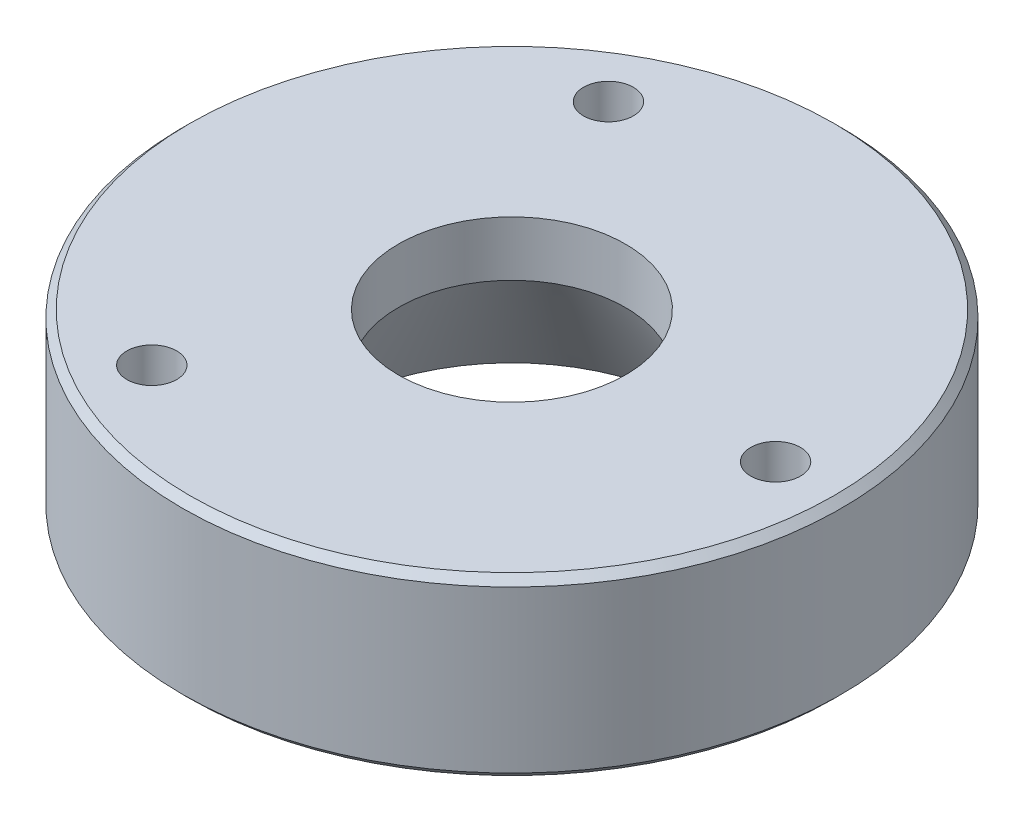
ISO-10303-21;
HEADER;
FILE_DESCRIPTION(('STEP AP214'),'2;1');
FILE_NAME('part.step','',(''),(''),'','','');
FILE_SCHEMA(('AUTOMOTIVE_DESIGN { 1 0 10303 214 1 1 1 1 }'));
ENDSEC;
DATA;
#1=APPLICATION_CONTEXT('core data for automotive mechanical design processes');
#2=APPLICATION_PROTOCOL_DEFINITION('international standard','automotive_design',2000,#1);
#3=PRODUCT_CONTEXT('',#1,'mechanical');
#4=PRODUCT('Part','Part','',(#3));
#5=PRODUCT_RELATED_PRODUCT_CATEGORY('part','',(#4));
#6=PRODUCT_DEFINITION_FORMATION('','',#4);
#7=PRODUCT_DEFINITION_CONTEXT('part definition',#1,'design');
#8=PRODUCT_DEFINITION('design','',#6,#7);
#9=PRODUCT_DEFINITION_SHAPE('','',#8);
#10=(LENGTH_UNIT() NAMED_UNIT(*) SI_UNIT(.MILLI.,.METRE.));
#11=(NAMED_UNIT(*) PLANE_ANGLE_UNIT() SI_UNIT($,.RADIAN.));
#12=(NAMED_UNIT(*) SI_UNIT($,.STERADIAN.) SOLID_ANGLE_UNIT());
#13=UNCERTAINTY_MEASURE_WITH_UNIT(LENGTH_MEASURE(1.E-05),#10,'distance_accuracy_value','');
#14=(GEOMETRIC_REPRESENTATION_CONTEXT(3) GLOBAL_UNCERTAINTY_ASSIGNED_CONTEXT((#13)) GLOBAL_UNIT_ASSIGNED_CONTEXT((#10,
#11,#12)) REPRESENTATION_CONTEXT('',''));
#15=CARTESIAN_POINT('',(0.,0.,0.));
#16=DIRECTION('',(0.,0.,1.));
#17=DIRECTION('',(1.,0.,0.));
#18=AXIS2_PLACEMENT_3D('',#15,#16,#17);
#19=CARTESIAN_POINT('',(-4.71844785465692E-13,24.,0.));
#20=DIRECTION('',(0.,1.,0.));
#21=DIRECTION('',(0.,0.,1.));
#22=AXIS2_PLACEMENT_3D('',#19,#20,#21);
#23=PLANE('',#22);
#24=CARTESIAN_POINT('',(-18.,24.,-31.1769145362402));
#25=DIRECTION('',(0.,1.,0.));
#26=DIRECTION('',(0.,0.,1.));
#27=AXIS2_PLACEMENT_3D('',#24,#25,#26);
#28=CIRCLE('',#27,3.4);
#29=CARTESIAN_POINT('',(-18.,24.,-27.7769145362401));
#30=VERTEX_POINT('',#29);
#31=EDGE_CURVE('E55',#30,#30,#28,.T.);
#32=ORIENTED_EDGE('',*,*,#31,.F.);
#33=EDGE_LOOP('',(#32));
#34=FACE_BOUND('',#33,.T.);
#35=CARTESIAN_POINT('',(-18.,24.,31.1769145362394));
#36=DIRECTION('',(0.,1.,0.));
#37=DIRECTION('',(0.,0.,1.));
#38=AXIS2_PLACEMENT_3D('',#35,#36,#37);
#39=CIRCLE('',#38,3.4);
#40=CARTESIAN_POINT('',(-18.,24.,34.5769145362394));
#41=VERTEX_POINT('',#40);
#42=EDGE_CURVE('E49',#41,#41,#39,.T.);
#43=ORIENTED_EDGE('',*,*,#42,.F.);
#44=EDGE_LOOP('',(#43));
#45=FACE_BOUND('',#44,.T.);
#46=CARTESIAN_POINT('',(36.,24.,-2.22044604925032E-13));
#47=DIRECTION('',(0.,1.,0.));
#48=DIRECTION('',(0.,0.,1.));
#49=AXIS2_PLACEMENT_3D('',#46,#47,#48);
#50=CIRCLE('',#49,3.4);
#51=CARTESIAN_POINT('',(36.,24.,3.39999999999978));
#52=VERTEX_POINT('',#51);
#53=EDGE_CURVE('E43',#52,#52,#50,.T.);
#54=ORIENTED_EDGE('',*,*,#53,.F.);
#55=EDGE_LOOP('',(#54));
#56=FACE_BOUND('',#55,.T.);
#57=CARTESIAN_POINT('',(-4.71844785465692E-13,24.,0.));
#58=DIRECTION('',(0.,1.,0.));
#59=DIRECTION('',(0.,0.,1.));
#60=AXIS2_PLACEMENT_3D('',#57,#58,#59);
#61=CIRCLE('',#60,44.);
#62=CARTESIAN_POINT('',(-4.74287276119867E-13,24.,43.9999999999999));
#63=VERTEX_POINT('',#62);
#64=EDGE_CURVE('E29',#63,#63,#61,.T.);
#65=ORIENTED_EDGE('',*,*,#64,.T.);
#66=EDGE_LOOP('',(#65));
#67=FACE_BOUND('',#66,.T.);
#68=CARTESIAN_POINT('',(-4.71844785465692E-13,24.,0.));
#69=DIRECTION('',(0.,1.,0.));
#70=DIRECTION('',(0.,0.,1.));
#71=AXIS2_PLACEMENT_3D('',#68,#69,#70);
#72=CIRCLE('',#71,15.5);
#73=CARTESIAN_POINT('',(-4.72705208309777E-13,24.,15.4999999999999));
#74=VERTEX_POINT('',#73);
#75=EDGE_CURVE('E34',#74,#74,#72,.T.);
#76=ORIENTED_EDGE('',*,*,#75,.F.);
#77=EDGE_LOOP('',(#76));
#78=FACE_BOUND('',#77,.T.);
#79=ADVANCED_FACE('F14',(#34,#45,#56,#67,#78),#23,.T.);
#80=CARTESIAN_POINT('',(0.,0.,0.));
#81=DIRECTION('',(0.,1.,0.));
#82=DIRECTION('',(0.,0.,1.));
#83=AXIS2_PLACEMENT_3D('',#80,#81,#82);
#84=PLANE('',#83);
#85=CARTESIAN_POINT('',(-17.9999999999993,0.,-31.1769145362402));
#86=DIRECTION('',(0.,1.,0.));
#87=DIRECTION('',(0.,0.,1.));
#88=AXIS2_PLACEMENT_3D('',#85,#86,#87);
#89=CIRCLE('',#88,3.4);
#90=CARTESIAN_POINT('',(-17.9999999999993,0.,-27.7769145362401));
#91=VERTEX_POINT('',#90);
#92=EDGE_CURVE('E58',#91,#91,#89,.T.);
#93=ORIENTED_EDGE('',*,*,#92,.T.);
#94=EDGE_LOOP('',(#93));
#95=FACE_BOUND('',#94,.T.);
#96=CARTESIAN_POINT('',(-18.,0.,31.1769145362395));
#97=DIRECTION('',(0.,1.,0.));
#98=DIRECTION('',(0.,0.,1.));
#99=AXIS2_PLACEMENT_3D('',#96,#97,#98);
#100=CIRCLE('',#99,3.4);
#101=CARTESIAN_POINT('',(-18.,0.,34.5769145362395));
#102=VERTEX_POINT('',#101);
#103=EDGE_CURVE('E52',#102,#102,#100,.T.);
#104=ORIENTED_EDGE('',*,*,#103,.T.);
#105=EDGE_LOOP('',(#104));
#106=FACE_BOUND('',#105,.T.);
#107=CARTESIAN_POINT('',(36.,0.,0.));
#108=DIRECTION('',(0.,1.,0.));
#109=DIRECTION('',(0.,0.,1.));
#110=AXIS2_PLACEMENT_3D('',#107,#108,#109);
#111=CIRCLE('',#110,3.4);
#112=CARTESIAN_POINT('',(36.,0.,3.4));
#113=VERTEX_POINT('',#112);
#114=EDGE_CURVE('E46',#113,#113,#111,.T.);
#115=ORIENTED_EDGE('',*,*,#114,.T.);
#116=EDGE_LOOP('',(#115));
#117=FACE_BOUND('',#116,.T.);
#118=CARTESIAN_POINT('',(0.,0.,0.));
#119=DIRECTION('',(0.,1.,0.));
#120=DIRECTION('',(0.,0.,1.));
#121=AXIS2_PLACEMENT_3D('',#118,#119,#120);
#122=CIRCLE('',#121,25.0262794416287);
#123=CARTESIAN_POINT('',(0.,0.,25.0262794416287));
#124=VERTEX_POINT('',#123);
#125=EDGE_CURVE('E37',#124,#124,#122,.T.);
#126=ORIENTED_EDGE('',*,*,#125,.T.);
#127=EDGE_LOOP('',(#126));
#128=FACE_BOUND('',#127,.T.);
#129=CARTESIAN_POINT('',(0.,0.,0.));
#130=DIRECTION('',(0.,1.,0.));
#131=DIRECTION('',(0.,0.,1.));
#132=AXIS2_PLACEMENT_3D('',#129,#130,#131);
#133=CIRCLE('',#132,44.);
#134=CARTESIAN_POINT('',(0.,0.,44.));
#135=VERTEX_POINT('',#134);
#136=EDGE_CURVE('E10',#135,#135,#133,.F.);
#137=ORIENTED_EDGE('',*,*,#136,.T.);
#138=EDGE_LOOP('',(#137));
#139=FACE_BOUND('',#138,.T.);
#140=ADVANCED_FACE('F62',(#95,#106,#117,#128,#139),#84,.F.);
#141=CARTESIAN_POINT('',(-4.71844785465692E-13,24.,0.));
#142=DIRECTION('',(0.,-1.,0.));
#143=DIRECTION('',(0.,0.,-1.));
#144=AXIS2_PLACEMENT_3D('',#141,#142,#143);
#145=CYLINDRICAL_SURFACE('',#144,45.);
#146=CARTESIAN_POINT('',(-3.88578058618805E-13,23.,-2.77555756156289E-13));
#147=DIRECTION('',(0.,1.,0.));
#148=DIRECTION('',(0.,0.,1.));
#149=AXIS2_PLACEMENT_3D('',#146,#147,#148);
#150=CIRCLE('',#149,45.);
#151=CARTESIAN_POINT('',(-3.91076060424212E-13,23.,44.9999999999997));
#152=VERTEX_POINT('',#151);
#153=EDGE_CURVE('E21',#152,#152,#150,.F.);
#154=ORIENTED_EDGE('',*,*,#153,.T.);
#155=EDGE_LOOP('',(#154));
#156=FACE_BOUND('',#155,.T.);
#157=CARTESIAN_POINT('',(-2.22044604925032E-13,1.,-1.11022302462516E-13));
#158=DIRECTION('',(0.,1.,0.));
#159=DIRECTION('',(0.,0.,1.));
#160=AXIS2_PLACEMENT_3D('',#157,#158,#159);
#161=CIRCLE('',#160,45.);
#162=CARTESIAN_POINT('',(-2.24542606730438E-13,1.,44.9999999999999));
#163=VERTEX_POINT('',#162);
#164=EDGE_CURVE('E25',#163,#163,#161,.T.);
#165=ORIENTED_EDGE('',*,*,#164,.T.);
#166=EDGE_LOOP('',(#165));
#167=FACE_BOUND('',#166,.T.);
#168=ADVANCED_FACE('F16',(#156,#167),#145,.T.);
#169=CARTESIAN_POINT('',(-4.71844785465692E-13,24.,0.));
#170=DIRECTION('',(0.,-1.,0.));
#171=DIRECTION('',(0.,0.,-1.));
#172=AXIS2_PLACEMENT_3D('',#169,#170,#171);
#173=CYLINDRICAL_SURFACE('',#172,15.5);
#174=CARTESIAN_POINT('',(-4.71844785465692E-13,16.5,0.));
#175=DIRECTION('',(0.,1.,0.));
#176=DIRECTION('',(0.,0.,1.));
#177=AXIS2_PLACEMENT_3D('',#174,#175,#176);
#178=CIRCLE('',#177,15.5);
#179=CARTESIAN_POINT('',(-4.72705208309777E-13,16.5,15.4999999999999));
#180=VERTEX_POINT('',#179);
#181=EDGE_CURVE('E40',#180,#180,#178,.T.);
#182=ORIENTED_EDGE('',*,*,#181,.F.);
#183=EDGE_LOOP('',(#182));
#184=FACE_BOUND('',#183,.T.);
#185=ORIENTED_EDGE('',*,*,#75,.T.);
#186=EDGE_LOOP('',(#185));
#187=FACE_BOUND('',#186,.T.);
#188=ADVANCED_FACE('F82',(#184,#187),#173,.F.);
#189=CARTESIAN_POINT('',(-4.71844785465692E-13,24.,0.));
#190=DIRECTION('',(0.,-1.,0.));
#191=DIRECTION('',(0.,0.,-1.));
#192=AXIS2_PLACEMENT_3D('',#189,#190,#191);
#193=CONICAL_SURFACE('',#192,44.,0.785398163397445);
#194=ORIENTED_EDGE('',*,*,#153,.F.);
#195=EDGE_LOOP('',(#194));
#196=FACE_BOUND('',#195,.T.);
#197=ORIENTED_EDGE('',*,*,#64,.F.);
#198=EDGE_LOOP('',(#197));
#199=FACE_BOUND('',#198,.T.);
#200=ADVANCED_FACE('F84',(#196,#199),#193,.T.);
#201=CARTESIAN_POINT('',(-2.22044604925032E-13,1.,-1.11022302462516E-13));
#202=DIRECTION('',(0.,1.,0.));
#203=DIRECTION('',(0.,0.,1.));
#204=AXIS2_PLACEMENT_3D('',#201,#202,#203);
#205=CONICAL_SURFACE('',#204,45.,0.785398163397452);
#206=ORIENTED_EDGE('',*,*,#136,.F.);
#207=EDGE_LOOP('',(#206));
#208=FACE_BOUND('',#207,.T.);
#209=ORIENTED_EDGE('',*,*,#164,.F.);
#210=EDGE_LOOP('',(#209));
#211=FACE_BOUND('',#210,.T.);
#212=ADVANCED_FACE('F93',(#208,#211),#205,.T.);
#213=CARTESIAN_POINT('',(-4.71844785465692E-13,16.5,0.));
#214=DIRECTION('',(0.,-1.,0.));
#215=DIRECTION('',(0.,0.,-1.));
#216=AXIS2_PLACEMENT_3D('',#213,#214,#215);
#217=CONICAL_SURFACE('',#216,15.5,0.523598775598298);
#218=ORIENTED_EDGE('',*,*,#125,.F.);
#219=EDGE_LOOP('',(#218));
#220=FACE_BOUND('',#219,.T.);
#221=ORIENTED_EDGE('',*,*,#181,.T.);
#222=EDGE_LOOP('',(#221));
#223=FACE_BOUND('',#222,.T.);
#224=ADVANCED_FACE('F141',(#220,#223),#217,.F.);
#225=CARTESIAN_POINT('',(36.,24.,-2.22044604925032E-13));
#226=DIRECTION('',(0.,1.,0.));
#227=DIRECTION('',(0.,0.,1.));
#228=AXIS2_PLACEMENT_3D('',#225,#226,#227);
#229=CYLINDRICAL_SURFACE('',#228,3.4);
#230=ORIENTED_EDGE('',*,*,#114,.F.);
#231=EDGE_LOOP('',(#230));
#232=FACE_BOUND('',#231,.T.);
#233=ORIENTED_EDGE('',*,*,#53,.T.);
#234=EDGE_LOOP('',(#233));
#235=FACE_BOUND('',#234,.T.);
#236=ADVANCED_FACE('F133',(#232,#235),#229,.F.);
#237=CARTESIAN_POINT('',(-18.,24.,31.1769145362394));
#238=DIRECTION('',(0.,1.,0.));
#239=DIRECTION('',(0.,0.,1.));
#240=AXIS2_PLACEMENT_3D('',#237,#238,#239);
#241=CYLINDRICAL_SURFACE('',#240,3.4);
#242=ORIENTED_EDGE('',*,*,#103,.F.);
#243=EDGE_LOOP('',(#242));
#244=FACE_BOUND('',#243,.T.);
#245=ORIENTED_EDGE('',*,*,#42,.T.);
#246=EDGE_LOOP('',(#245));
#247=FACE_BOUND('',#246,.T.);
#248=ADVANCED_FACE('F68',(#244,#247),#241,.F.);
#249=CARTESIAN_POINT('',(-18.,24.,-31.1769145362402));
#250=DIRECTION('',(0.,1.,0.));
#251=DIRECTION('',(0.,0.,1.));
#252=AXIS2_PLACEMENT_3D('',#249,#250,#251);
#253=CYLINDRICAL_SURFACE('',#252,3.4);
#254=ORIENTED_EDGE('',*,*,#92,.F.);
#255=EDGE_LOOP('',(#254));
#256=FACE_BOUND('',#255,.T.);
#257=ORIENTED_EDGE('',*,*,#31,.T.);
#258=EDGE_LOOP('',(#257));
#259=FACE_BOUND('',#258,.T.);
#260=ADVANCED_FACE('F65',(#256,#259),#253,.F.);
#261=CLOSED_SHELL('',(#79,#140,#168,#188,#200,#212,#224,#236,#248,#260));
#262=MANIFOLD_SOLID_BREP('B1',#261);
#263=ADVANCED_BREP_SHAPE_REPRESENTATION('',(#18,#262),#14);
#264=SHAPE_DEFINITION_REPRESENTATION(#9,#263);
ENDSEC;
END-ISO-10303-21;
